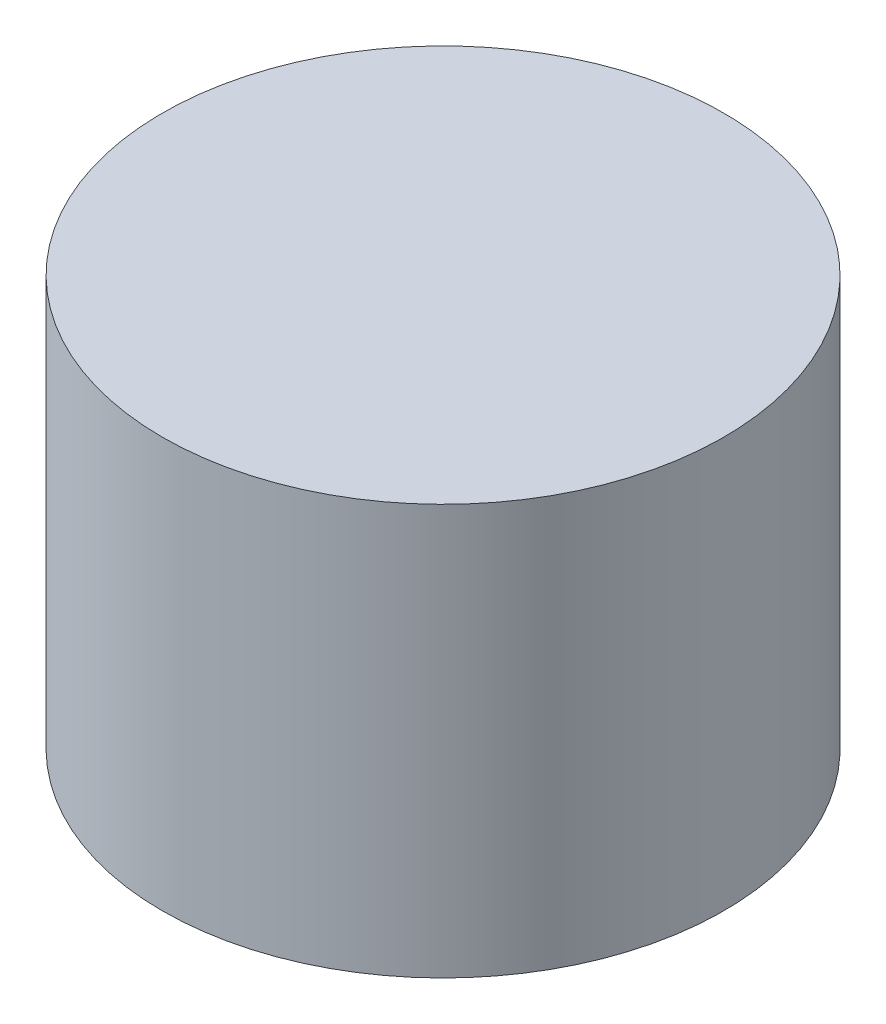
from build123d import *

# Parameters (mm, degrees)
SKETCH2_R           = 15
BOSS_EXTRUDE1_DEPTH = 10.96


with BuildPart() as part:
    # Sketch2 → Boss-Extrude1 (new, symmetric)
    with BuildSketch(Plane(origin=(0, 0, 0), x_dir=(1, 0, 0), z_dir=(0, 1, 0))):
        with Locations(Location((0, 0, 0), (0, 0, 270))):
            Circle(SKETCH2_R)
    extrude(amount=BOSS_EXTRUDE1_DEPTH, both=True)


solid = part.part
